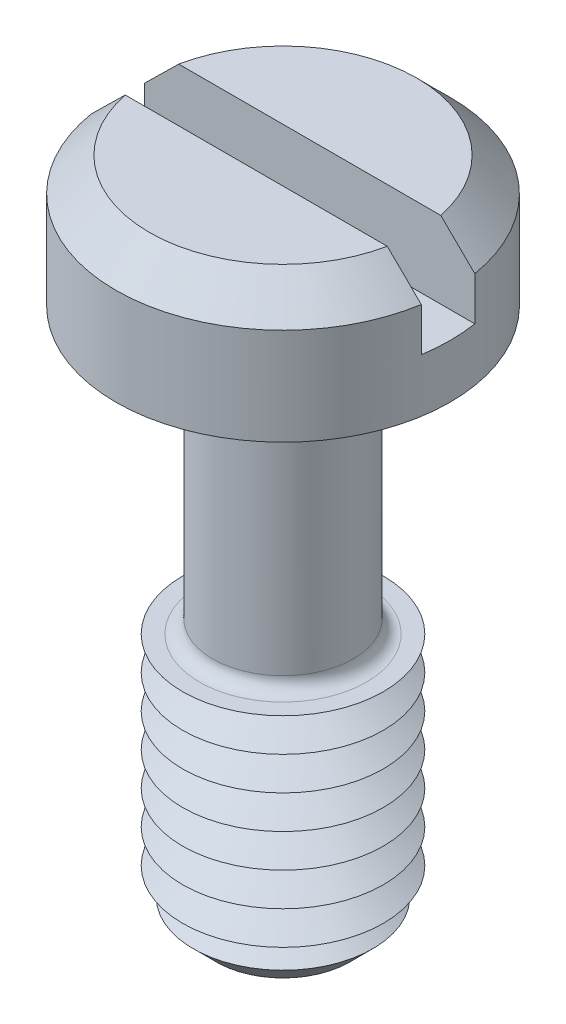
from build123d import *

# Parameters (mm, degrees)
SKETCH1_R           = 5
BOSS_EXTRUDE1_DEPTH = 3.9
SKETCH2_R           = 2.1
BOSS_EXTRUDE2_DEPTH = 16
SKETCH3_R           = 3
BOSS_EXTRUDE3_DEPTH = 7.5
CHAMFER1_SIZE       = 1
LPATTERN1_COUNT     = 7
LPATTERN1_PITCH     = 1
FILLET1_R           = 0.4
CHAMFER2_SIZE       = 1
SKETCH6_W           = 10
SKETCH6_H           = 1.6
CUT_EXTRUDE1_DEPTH  = 2.3


with BuildPart() as part:
    # Sketch1 → Boss-Extrude1 (new body)
    with BuildSketch(Plane(origin=(0, 0, 0), x_dir=(1, 0, 0), z_dir=(0, 1, 0))):
        with Locations(Location((0, 0, 0), (0, 0, 270))):
            Circle(SKETCH1_R)
    extrude(amount=BOSS_EXTRUDE1_DEPTH)

    # Sketch2 → Boss-Extrude2 (add)
    with BuildSketch(Plane.XZ):
        with Locations(Location((0, 0, 0), (0, 0, 270))):
            Circle(SKETCH2_R)
    extrude(amount=BOSS_EXTRUDE2_DEPTH)

    # Sketch3 → Boss-Extrude3 (add)
    with BuildSketch(Plane.XZ.offset(16)):
        with Locations(Location((0, 0, 0), (0, 0, 270))):
            Circle(SKETCH3_R)
    extrude(amount=-BOSS_EXTRUDE3_DEPTH)

    # Chamfer1
    chamfer1_edges = [part.edges().sort_by_distance(p)[0] for p in [
        (0, -16, 3),
    ]]
    chamfer(chamfer1_edges, length=CHAMFER1_SIZE)

    # Sketch5 → Cut-Revolve1 (revolve, cut)
    with BuildSketch(Plane(origin=(0, 0, 0), x_dir=(0, 0, -1), z_dir=(1, 0, 0))):
        Polygon((-3, -8.5), (-2.133974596, -9), (-3, -9.5), align=None)
    cut_revolve1 = revolve(axis=Axis((0, -6.58711856, 0), (0, -1, 0)), mode=Mode.SUBTRACT)

    # LPattern1: Cut-Revolve1 ×7
    with Locations(*[(0, -i * LPATTERN1_PITCH, 0) for i in range(1, LPATTERN1_COUNT)]):
        add(cut_revolve1, mode=Mode.SUBTRACT)

    # Fillet1
    fillet1_edges = [part.edges().sort_by_distance(p)[0] for p in [
        (0, 0, 2.1),
        (0, -8.5, 2.1),
    ]]
    fillet(fillet1_edges, radius=FILLET1_R)

    # Chamfer2
    chamfer2_edges = [part.edges().sort_by_distance(p)[0] for p in [
        (0, 3.9, -5),
    ]]
    chamfer(chamfer2_edges, length=CHAMFER2_SIZE)

    # Sketch6 → Cut-Extrude1 (cut)
    with BuildSketch(Plane(origin=(0, 3.9, 0), x_dir=(1, 0, 0), z_dir=(0, 1, 0))):
        Rectangle(SKETCH6_W, SKETCH6_H)
    extrude(amount=-CUT_EXTRUDE1_DEPTH, mode=Mode.SUBTRACT)


solid = part.part
